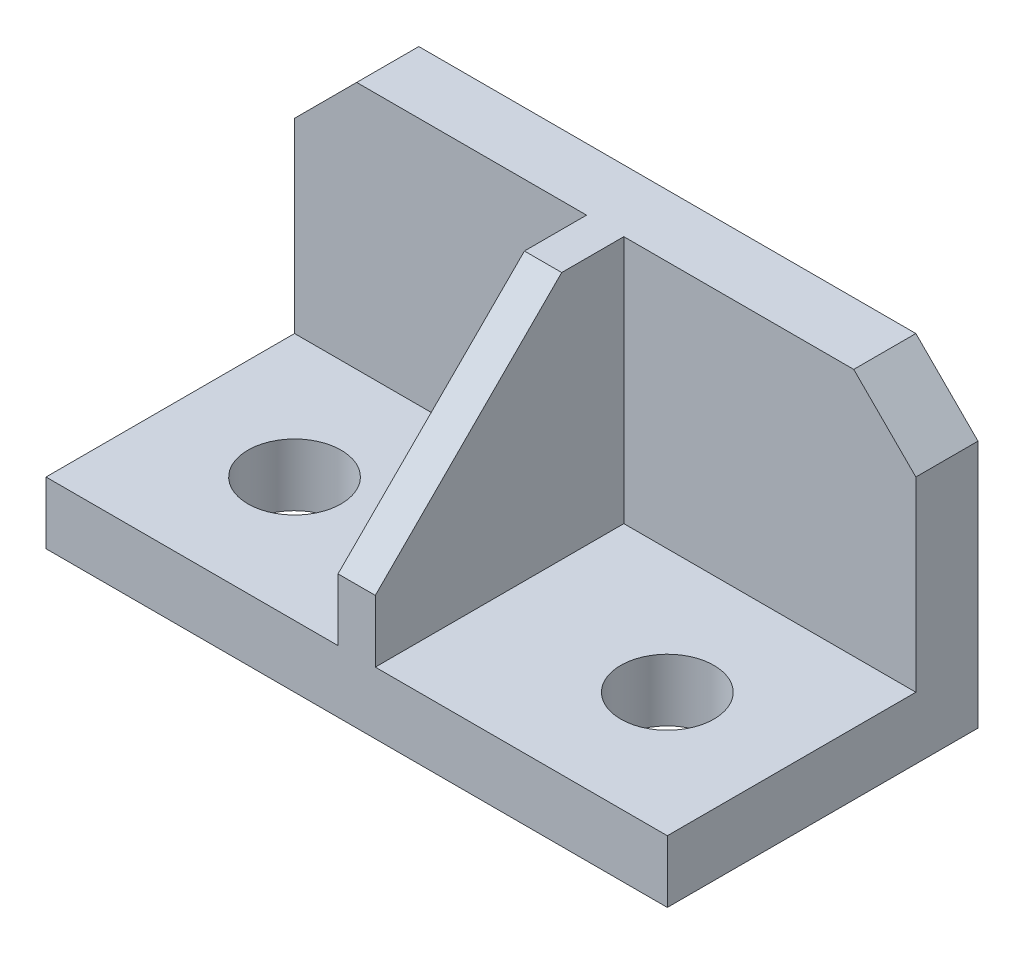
ISO-10303-21;
HEADER;
FILE_DESCRIPTION(('STEP AP214'),'2;1');
FILE_NAME('part.step','',(''),(''),'','','');
FILE_SCHEMA(('AUTOMOTIVE_DESIGN { 1 0 10303 214 1 1 1 1 }'));
ENDSEC;
DATA;
#1=APPLICATION_CONTEXT('core data for automotive mechanical design processes');
#2=APPLICATION_PROTOCOL_DEFINITION('international standard','automotive_design',2000,#1);
#3=PRODUCT_CONTEXT('',#1,'mechanical');
#4=PRODUCT('Part','Part','',(#3));
#5=PRODUCT_RELATED_PRODUCT_CATEGORY('part','',(#4));
#6=PRODUCT_DEFINITION_FORMATION('','',#4);
#7=PRODUCT_DEFINITION_CONTEXT('part definition',#1,'design');
#8=PRODUCT_DEFINITION('design','',#6,#7);
#9=PRODUCT_DEFINITION_SHAPE('','',#8);
#10=(LENGTH_UNIT() NAMED_UNIT(*) SI_UNIT(.MILLI.,.METRE.));
#11=(NAMED_UNIT(*) PLANE_ANGLE_UNIT() SI_UNIT($,.RADIAN.));
#12=(NAMED_UNIT(*) SI_UNIT($,.STERADIAN.) SOLID_ANGLE_UNIT());
#13=UNCERTAINTY_MEASURE_WITH_UNIT(LENGTH_MEASURE(1.E-05),#10,'distance_accuracy_value','');
#14=(GEOMETRIC_REPRESENTATION_CONTEXT(3) GLOBAL_UNCERTAINTY_ASSIGNED_CONTEXT((#13)) GLOBAL_UNIT_ASSIGNED_CONTEXT((#10,
#11,#12)) REPRESENTATION_CONTEXT('',''));
#15=CARTESIAN_POINT('',(0.,0.,0.));
#16=DIRECTION('',(0.,0.,1.));
#17=DIRECTION('',(1.,0.,0.));
#18=AXIS2_PLACEMENT_3D('',#15,#16,#17);
#19=CARTESIAN_POINT('',(0.,50.,-40.));
#20=DIRECTION('',(0.,0.,1.));
#21=DIRECTION('',(1.,0.,0.));
#22=AXIS2_PLACEMENT_3D('',#19,#20,#21);
#23=PLANE('',#22);
#24=DIRECTION('',(0.,-1.,0.));
#25=VECTOR('',#24,1.);
#26=CARTESIAN_POINT('',(100.,50.,-40.));
#27=LINE('',#26,#25);
#28=CARTESIAN_POINT('',(100.,40.,-40.));
#29=VERTEX_POINT('',#28);
#30=CARTESIAN_POINT('',(100.,10.,-40.));
#31=VERTEX_POINT('',#30);
#32=EDGE_CURVE('E182',#29,#31,#27,.T.);
#33=ORIENTED_EDGE('',*,*,#32,.F.);
#34=DIRECTION('',(0.707106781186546,-0.70710678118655,0.));
#35=VECTOR('',#34,1.);
#36=CARTESIAN_POINT('',(45.0000000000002,95.,-40.));
#37=LINE('',#36,#35);
#38=CARTESIAN_POINT('',(90.,50.,-40.));
#39=VERTEX_POINT('',#38);
#40=EDGE_CURVE('E224',#29,#39,#37,.F.);
#41=ORIENTED_EDGE('',*,*,#40,.T.);
#42=DIRECTION('',(-1.,0.,0.));
#43=VECTOR('',#42,1.);
#44=CARTESIAN_POINT('',(0.,50.,-40.));
#45=LINE('',#44,#43);
#46=CARTESIAN_POINT('',(53.,50.,-40.));
#47=VERTEX_POINT('',#46);
#48=EDGE_CURVE('E183',#39,#47,#45,.T.);
#49=ORIENTED_EDGE('',*,*,#48,.T.);
#50=DIRECTION('',(0.,-1.,0.));
#51=VECTOR('',#50,1.);
#52=CARTESIAN_POINT('',(53.,90.4474968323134,-40.));
#53=LINE('',#52,#51);
#54=CARTESIAN_POINT('',(53.,10.,-40.));
#55=VERTEX_POINT('',#54);
#56=EDGE_CURVE('E160',#47,#55,#53,.T.);
#57=ORIENTED_EDGE('',*,*,#56,.T.);
#58=DIRECTION('',(-1.,0.,0.));
#59=VECTOR('',#58,1.);
#60=CARTESIAN_POINT('',(0.,10.,-40.));
#61=LINE('',#60,#59);
#62=EDGE_CURVE('E175',#31,#55,#61,.T.);
#63=ORIENTED_EDGE('',*,*,#62,.F.);
#64=EDGE_LOOP('',(#33,#41,#49,#57,#63));
#65=FACE_BOUND('',#64,.T.);
#66=ADVANCED_FACE('F31',(#65),#23,.T.);
#67=CARTESIAN_POINT('',(47.,50.,-40.));
#68=VERTEX_POINT('',#67);
#69=CARTESIAN_POINT('',(10.,50.,-40.));
#70=VERTEX_POINT('',#69);
#71=EDGE_CURVE('E178',#68,#70,#45,.T.);
#72=ORIENTED_EDGE('',*,*,#71,.T.);
#73=DIRECTION('',(0.707106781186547,0.707106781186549,0.));
#74=VECTOR('',#73,1.);
#75=CARTESIAN_POINT('',(5.,45.,-40.));
#76=LINE('',#75,#74);
#77=CARTESIAN_POINT('',(0.,40.,-40.));
#78=VERTEX_POINT('',#77);
#79=EDGE_CURVE('E226',#70,#78,#76,.F.);
#80=ORIENTED_EDGE('',*,*,#79,.T.);
#81=DIRECTION('',(0.,-1.,0.));
#82=VECTOR('',#81,1.);
#83=CARTESIAN_POINT('',(0.,50.,-40.));
#84=LINE('',#83,#82);
#85=CARTESIAN_POINT('',(0.,10.,-40.));
#86=VERTEX_POINT('',#85);
#87=EDGE_CURVE('E180',#78,#86,#84,.T.);
#88=ORIENTED_EDGE('',*,*,#87,.T.);
#89=CARTESIAN_POINT('',(47.,10.,-40.));
#90=VERTEX_POINT('',#89);
#91=EDGE_CURVE('E179',#90,#86,#61,.T.);
#92=ORIENTED_EDGE('',*,*,#91,.F.);
#93=DIRECTION('',(0.,-1.,0.));
#94=VECTOR('',#93,1.);
#95=CARTESIAN_POINT('',(47.,90.4474968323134,-40.));
#96=LINE('',#95,#94);
#97=EDGE_CURVE('E150',#68,#90,#96,.T.);
#98=ORIENTED_EDGE('',*,*,#97,.F.);
#99=EDGE_LOOP('',(#72,#80,#88,#92,#98));
#100=FACE_BOUND('',#99,.T.);
#101=ADVANCED_FACE('F249',(#100),#23,.T.);
#102=CARTESIAN_POINT('',(0.,10.,-50.));
#103=DIRECTION('',(0.,-1.,0.));
#104=DIRECTION('',(0.,0.,-1.));
#105=AXIS2_PLACEMENT_3D('',#102,#103,#104);
#106=PLANE('',#105);
#107=CARTESIAN_POINT('',(80.,10.,-20.));
#108=DIRECTION('',(0.,1.,0.));
#109=DIRECTION('',(0.,0.,1.));
#110=AXIS2_PLACEMENT_3D('',#107,#108,#109);
#111=CIRCLE('',#110,7.50000000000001);
#112=CARTESIAN_POINT('',(80.,10.,-12.5));
#113=VERTEX_POINT('',#112);
#114=EDGE_CURVE('E167',#113,#113,#111,.T.);
#115=ORIENTED_EDGE('',*,*,#114,.F.);
#116=EDGE_LOOP('',(#115));
#117=FACE_BOUND('',#116,.T.);
#118=DIRECTION('',(0.,0.,-1.));
#119=VECTOR('',#118,1.);
#120=CARTESIAN_POINT('',(53.,10.,-40.));
#121=LINE('',#120,#119);
#122=CARTESIAN_POINT('',(53.,10.,0.));
#123=VERTEX_POINT('',#122);
#124=EDGE_CURVE('E151',#123,#55,#121,.T.);
#125=ORIENTED_EDGE('',*,*,#124,.F.);
#126=DIRECTION('',(1.,0.,0.));
#127=VECTOR('',#126,1.);
#128=CARTESIAN_POINT('',(0.,10.,0.));
#129=LINE('',#128,#127);
#130=CARTESIAN_POINT('',(100.,10.,0.));
#131=VERTEX_POINT('',#130);
#132=EDGE_CURVE('E145',#123,#131,#129,.T.);
#133=ORIENTED_EDGE('',*,*,#132,.T.);
#134=DIRECTION('',(0.,0.,-1.));
#135=VECTOR('',#134,1.);
#136=CARTESIAN_POINT('',(100.,10.,-50.0000000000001));
#137=LINE('',#136,#135);
#138=EDGE_CURVE('E144',#131,#31,#137,.T.);
#139=ORIENTED_EDGE('',*,*,#138,.T.);
#140=ORIENTED_EDGE('',*,*,#62,.T.);
#141=EDGE_LOOP('',(#125,#133,#139,#140));
#142=FACE_BOUND('',#141,.T.);
#143=ADVANCED_FACE('F263',(#117,#142),#106,.F.);
#144=CARTESIAN_POINT('',(20.,10.,-20.));
#145=DIRECTION('',(0.,1.,0.));
#146=DIRECTION('',(0.,0.,1.));
#147=AXIS2_PLACEMENT_3D('',#144,#145,#146);
#148=CIRCLE('',#147,7.5);
#149=CARTESIAN_POINT('',(20.,10.,-12.5));
#150=VERTEX_POINT('',#149);
#151=EDGE_CURVE('E166',#150,#150,#148,.T.);
#152=ORIENTED_EDGE('',*,*,#151,.F.);
#153=EDGE_LOOP('',(#152));
#154=FACE_BOUND('',#153,.T.);
#155=DIRECTION('',(0.,0.,1.));
#156=VECTOR('',#155,1.);
#157=CARTESIAN_POINT('',(47.,10.,-40.));
#158=LINE('',#157,#156);
#159=CARTESIAN_POINT('',(47.,10.,0.));
#160=VERTEX_POINT('',#159);
#161=EDGE_CURVE('E140',#90,#160,#158,.T.);
#162=ORIENTED_EDGE('',*,*,#161,.F.);
#163=ORIENTED_EDGE('',*,*,#91,.T.);
#164=DIRECTION('',(0.,0.,1.));
#165=VECTOR('',#164,1.);
#166=CARTESIAN_POINT('',(0.,10.,-50.));
#167=LINE('',#166,#165);
#168=CARTESIAN_POINT('',(0.,10.,0.));
#169=VERTEX_POINT('',#168);
#170=EDGE_CURVE('E143',#86,#169,#167,.T.);
#171=ORIENTED_EDGE('',*,*,#170,.T.);
#172=EDGE_CURVE('E129',#169,#160,#129,.T.);
#173=ORIENTED_EDGE('',*,*,#172,.T.);
#174=EDGE_LOOP('',(#162,#163,#171,#173));
#175=FACE_BOUND('',#174,.T.);
#176=ADVANCED_FACE('F138',(#154,#175),#106,.F.);
#177=CARTESIAN_POINT('',(0.,50.,0.));
#178=DIRECTION('',(1.,0.,0.));
#179=DIRECTION('',(0.,0.,-1.));
#180=AXIS2_PLACEMENT_3D('',#177,#178,#179);
#181=PLANE('',#180);
#182=ORIENTED_EDGE('',*,*,#87,.F.);
#183=DIRECTION('',(0.,0.,-1.));
#184=VECTOR('',#183,1.);
#185=CARTESIAN_POINT('',(0.,40.,0.));
#186=LINE('',#185,#184);
#187=CARTESIAN_POINT('',(0.,40.,-50.));
#188=VERTEX_POINT('',#187);
#189=EDGE_CURVE('E228',#78,#188,#186,.T.);
#190=ORIENTED_EDGE('',*,*,#189,.T.);
#191=DIRECTION('',(0.,-1.,0.));
#192=VECTOR('',#191,1.);
#193=CARTESIAN_POINT('',(0.,50.,-50.));
#194=LINE('',#193,#192);
#195=CARTESIAN_POINT('',(0.,0.,-50.));
#196=VERTEX_POINT('',#195);
#197=EDGE_CURVE('E193',#188,#196,#194,.T.);
#198=ORIENTED_EDGE('',*,*,#197,.T.);
#199=DIRECTION('',(0.,0.,1.));
#200=VECTOR('',#199,1.);
#201=CARTESIAN_POINT('',(0.,0.,0.));
#202=LINE('',#201,#200);
#203=CARTESIAN_POINT('',(0.,0.,0.));
#204=VERTEX_POINT('',#203);
#205=EDGE_CURVE('E188',#196,#204,#202,.T.);
#206=ORIENTED_EDGE('',*,*,#205,.T.);
#207=DIRECTION('',(0.,-1.,0.));
#208=VECTOR('',#207,1.);
#209=CARTESIAN_POINT('',(0.,50.,0.));
#210=LINE('',#209,#208);
#211=EDGE_CURVE('E210',#169,#204,#210,.T.);
#212=ORIENTED_EDGE('',*,*,#211,.F.);
#213=ORIENTED_EDGE('',*,*,#170,.F.);
#214=EDGE_LOOP('',(#182,#190,#198,#206,#212,#213));
#215=FACE_BOUND('',#214,.T.);
#216=ADVANCED_FACE('F235',(#215),#181,.F.);
#217=CARTESIAN_POINT('',(0.,50.,0.));
#218=DIRECTION('',(0.,0.,-1.));
#219=DIRECTION('',(-1.,0.,0.));
#220=AXIS2_PLACEMENT_3D('',#217,#218,#219);
#221=PLANE('',#220);
#222=DIRECTION('',(0.,-1.,0.));
#223=VECTOR('',#222,1.);
#224=CARTESIAN_POINT('',(53.,90.4474968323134,0.));
#225=LINE('',#224,#223);
#226=CARTESIAN_POINT('',(53.,20.,0.));
#227=VERTEX_POINT('',#226);
#228=EDGE_CURVE('E135',#227,#123,#225,.T.);
#229=ORIENTED_EDGE('',*,*,#228,.F.);
#230=DIRECTION('',(-1.,0.,0.));
#231=VECTOR('',#230,1.);
#232=CARTESIAN_POINT('',(0.,20.,0.));
#233=LINE('',#232,#231);
#234=CARTESIAN_POINT('',(47.,20.,0.));
#235=VERTEX_POINT('',#234);
#236=EDGE_CURVE('E132',#227,#235,#233,.T.);
#237=ORIENTED_EDGE('',*,*,#236,.T.);
#238=DIRECTION('',(0.,-1.,0.));
#239=VECTOR('',#238,1.);
#240=CARTESIAN_POINT('',(47.,90.4474968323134,0.));
#241=LINE('',#240,#239);
#242=EDGE_CURVE('E125',#235,#160,#241,.T.);
#243=ORIENTED_EDGE('',*,*,#242,.T.);
#244=ORIENTED_EDGE('',*,*,#172,.F.);
#245=ORIENTED_EDGE('',*,*,#211,.T.);
#246=DIRECTION('',(1.,0.,0.));
#247=VECTOR('',#246,1.);
#248=CARTESIAN_POINT('',(0.,0.,0.));
#249=LINE('',#248,#247);
#250=CARTESIAN_POINT('',(100.,0.,0.));
#251=VERTEX_POINT('',#250);
#252=EDGE_CURVE('E197',#204,#251,#249,.T.);
#253=ORIENTED_EDGE('',*,*,#252,.T.);
#254=DIRECTION('',(0.,-1.,0.));
#255=VECTOR('',#254,1.);
#256=CARTESIAN_POINT('',(100.,50.,0.));
#257=LINE('',#256,#255);
#258=EDGE_CURVE('E208',#131,#251,#257,.T.);
#259=ORIENTED_EDGE('',*,*,#258,.F.);
#260=ORIENTED_EDGE('',*,*,#132,.F.);
#261=EDGE_LOOP('',(#229,#237,#243,#244,#245,#253,#259,#260));
#262=FACE_BOUND('',#261,.T.);
#263=ADVANCED_FACE('F128',(#262),#221,.F.);
#264=CARTESIAN_POINT('',(100.,50.,0.));
#265=DIRECTION('',(-1.,0.,0.));
#266=DIRECTION('',(0.,0.,1.));
#267=AXIS2_PLACEMENT_3D('',#264,#265,#266);
#268=PLANE('',#267);
#269=DIRECTION('',(0.,-1.,0.));
#270=VECTOR('',#269,1.);
#271=CARTESIAN_POINT('',(100.,50.,-50.));
#272=LINE('',#271,#270);
#273=CARTESIAN_POINT('',(100.,40.,-50.));
#274=VERTEX_POINT('',#273);
#275=CARTESIAN_POINT('',(100.,0.,-50.));
#276=VERTEX_POINT('',#275);
#277=EDGE_CURVE('E206',#274,#276,#272,.T.);
#278=ORIENTED_EDGE('',*,*,#277,.F.);
#279=DIRECTION('',(0.,0.,1.));
#280=VECTOR('',#279,1.);
#281=CARTESIAN_POINT('',(100.,40.,0.));
#282=LINE('',#281,#280);
#283=EDGE_CURVE('E222',#274,#29,#282,.T.);
#284=ORIENTED_EDGE('',*,*,#283,.T.);
#285=ORIENTED_EDGE('',*,*,#32,.T.);
#286=ORIENTED_EDGE('',*,*,#138,.F.);
#287=ORIENTED_EDGE('',*,*,#258,.T.);
#288=DIRECTION('',(0.,0.,-1.));
#289=VECTOR('',#288,1.);
#290=CARTESIAN_POINT('',(100.,0.,0.));
#291=LINE('',#290,#289);
#292=EDGE_CURVE('E200',#251,#276,#291,.T.);
#293=ORIENTED_EDGE('',*,*,#292,.T.);
#294=EDGE_LOOP('',(#278,#284,#285,#286,#287,#293));
#295=FACE_BOUND('',#294,.T.);
#296=ADVANCED_FACE('F257',(#295),#268,.F.);
#297=CARTESIAN_POINT('',(0.,50.,-50.));
#298=DIRECTION('',(0.,-1.,0.));
#299=DIRECTION('',(0.,0.,-1.));
#300=AXIS2_PLACEMENT_3D('',#297,#298,#299);
#301=PLANE('',#300);
#302=DIRECTION('',(0.,0.,-1.));
#303=VECTOR('',#302,1.);
#304=CARTESIAN_POINT('',(47.,50.,-40.));
#305=LINE('',#304,#303);
#306=CARTESIAN_POINT('',(47.,50.,-30.0000000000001));
#307=VERTEX_POINT('',#306);
#308=EDGE_CURVE('E156',#307,#68,#305,.T.);
#309=ORIENTED_EDGE('',*,*,#308,.F.);
#310=DIRECTION('',(1.,0.,0.));
#311=VECTOR('',#310,1.);
#312=CARTESIAN_POINT('',(0.,50.,-30.0000000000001));
#313=LINE('',#312,#311);
#314=CARTESIAN_POINT('',(53.,50.,-30.0000000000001));
#315=VERTEX_POINT('',#314);
#316=EDGE_CURVE('E39',#307,#315,#313,.T.);
#317=ORIENTED_EDGE('',*,*,#316,.T.);
#318=DIRECTION('',(0.,0.,1.));
#319=VECTOR('',#318,1.);
#320=CARTESIAN_POINT('',(53.,50.,-40.));
#321=LINE('',#320,#319);
#322=EDGE_CURVE('E134',#47,#315,#321,.T.);
#323=ORIENTED_EDGE('',*,*,#322,.F.);
#324=ORIENTED_EDGE('',*,*,#48,.F.);
#325=DIRECTION('',(0.,0.,-1.));
#326=VECTOR('',#325,1.);
#327=CARTESIAN_POINT('',(90.,50.,-50.));
#328=LINE('',#327,#326);
#329=CARTESIAN_POINT('',(90.,50.,-50.));
#330=VERTEX_POINT('',#329);
#331=EDGE_CURVE('E215',#39,#330,#328,.T.);
#332=ORIENTED_EDGE('',*,*,#331,.T.);
#333=DIRECTION('',(-1.,0.,0.));
#334=VECTOR('',#333,1.);
#335=CARTESIAN_POINT('',(0.,50.,-50.));
#336=LINE('',#335,#334);
#337=CARTESIAN_POINT('',(9.99999999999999,50.,-50.));
#338=VERTEX_POINT('',#337);
#339=EDGE_CURVE('E190',#330,#338,#336,.T.);
#340=ORIENTED_EDGE('',*,*,#339,.T.);
#341=DIRECTION('',(0.,0.,1.));
#342=VECTOR('',#341,1.);
#343=CARTESIAN_POINT('',(9.99999999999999,50.,-50.));
#344=LINE('',#343,#342);
#345=EDGE_CURVE('E212',#338,#70,#344,.T.);
#346=ORIENTED_EDGE('',*,*,#345,.T.);
#347=ORIENTED_EDGE('',*,*,#71,.F.);
#348=EDGE_LOOP('',(#309,#317,#323,#324,#332,#340,#346,#347));
#349=FACE_BOUND('',#348,.T.);
#350=ADVANCED_FACE('F247',(#349),#301,.F.);
#351=CARTESIAN_POINT('',(0.,50.,-50.));
#352=DIRECTION('',(0.,0.,1.));
#353=DIRECTION('',(1.,0.,0.));
#354=AXIS2_PLACEMENT_3D('',#351,#352,#353);
#355=PLANE('',#354);
#356=ORIENTED_EDGE('',*,*,#339,.F.);
#357=DIRECTION('',(-0.707106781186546,0.70710678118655,0.));
#358=VECTOR('',#357,1.);
#359=CARTESIAN_POINT('',(90.,50.,-50.));
#360=LINE('',#359,#358);
#361=EDGE_CURVE('E220',#330,#274,#360,.F.);
#362=ORIENTED_EDGE('',*,*,#361,.T.);
#363=ORIENTED_EDGE('',*,*,#277,.T.);
#364=DIRECTION('',(-1.,0.,0.));
#365=VECTOR('',#364,1.);
#366=CARTESIAN_POINT('',(0.,0.,-50.));
#367=LINE('',#366,#365);
#368=EDGE_CURVE('E194',#276,#196,#367,.T.);
#369=ORIENTED_EDGE('',*,*,#368,.T.);
#370=ORIENTED_EDGE('',*,*,#197,.F.);
#371=DIRECTION('',(-0.707106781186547,-0.707106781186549,0.));
#372=VECTOR('',#371,1.);
#373=CARTESIAN_POINT('',(9.99999999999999,50.,-50.));
#374=LINE('',#373,#372);
#375=EDGE_CURVE('E218',#188,#338,#374,.F.);
#376=ORIENTED_EDGE('',*,*,#375,.T.);
#377=EDGE_LOOP('',(#356,#362,#363,#369,#370,#376));
#378=FACE_BOUND('',#377,.T.);
#379=ADVANCED_FACE('F240',(#378),#355,.F.);
#380=CARTESIAN_POINT('',(0.,0.,-50.));
#381=DIRECTION('',(0.,-1.,0.));
#382=DIRECTION('',(0.,0.,-1.));
#383=AXIS2_PLACEMENT_3D('',#380,#381,#382);
#384=PLANE('',#383);
#385=CARTESIAN_POINT('',(80.,0.,-20.));
#386=DIRECTION('',(0.,1.,0.));
#387=DIRECTION('',(0.,0.,1.));
#388=AXIS2_PLACEMENT_3D('',#385,#386,#387);
#389=CIRCLE('',#388,7.50000000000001);
#390=CARTESIAN_POINT('',(80.,0.,-12.5));
#391=VERTEX_POINT('',#390);
#392=EDGE_CURVE('E163',#391,#391,#389,.T.);
#393=ORIENTED_EDGE('',*,*,#392,.T.);
#394=EDGE_LOOP('',(#393));
#395=FACE_BOUND('',#394,.T.);
#396=CARTESIAN_POINT('',(20.,0.,-20.));
#397=DIRECTION('',(0.,1.,0.));
#398=DIRECTION('',(0.,0.,1.));
#399=AXIS2_PLACEMENT_3D('',#396,#397,#398);
#400=CIRCLE('',#399,7.5);
#401=CARTESIAN_POINT('',(20.,0.,-12.5));
#402=VERTEX_POINT('',#401);
#403=EDGE_CURVE('E170',#402,#402,#400,.T.);
#404=ORIENTED_EDGE('',*,*,#403,.T.);
#405=EDGE_LOOP('',(#404));
#406=FACE_BOUND('',#405,.T.);
#407=ORIENTED_EDGE('',*,*,#205,.F.);
#408=ORIENTED_EDGE('',*,*,#368,.F.);
#409=ORIENTED_EDGE('',*,*,#292,.F.);
#410=ORIENTED_EDGE('',*,*,#252,.F.);
#411=EDGE_LOOP('',(#407,#408,#409,#410));
#412=FACE_BOUND('',#411,.T.);
#413=ADVANCED_FACE('F254',(#395,#406,#412),#384,.T.);
#414=CARTESIAN_POINT('',(20.,0.,-20.));
#415=DIRECTION('',(0.,1.,0.));
#416=DIRECTION('',(0.,0.,1.));
#417=AXIS2_PLACEMENT_3D('',#414,#415,#416);
#418=CYLINDRICAL_SURFACE('',#417,7.5);
#419=ORIENTED_EDGE('',*,*,#403,.F.);
#420=EDGE_LOOP('',(#419));
#421=FACE_BOUND('',#420,.T.);
#422=ORIENTED_EDGE('',*,*,#151,.T.);
#423=EDGE_LOOP('',(#422));
#424=FACE_BOUND('',#423,.T.);
#425=ADVANCED_FACE('F284',(#421,#424),#418,.F.);
#426=CARTESIAN_POINT('',(80.,0.,-20.));
#427=DIRECTION('',(0.,1.,0.));
#428=DIRECTION('',(0.,0.,1.));
#429=AXIS2_PLACEMENT_3D('',#426,#427,#428);
#430=CYLINDRICAL_SURFACE('',#429,7.50000000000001);
#431=ORIENTED_EDGE('',*,*,#392,.F.);
#432=EDGE_LOOP('',(#431));
#433=FACE_BOUND('',#432,.T.);
#434=ORIENTED_EDGE('',*,*,#114,.T.);
#435=EDGE_LOOP('',(#434));
#436=FACE_BOUND('',#435,.T.);
#437=ADVANCED_FACE('F314',(#433,#436),#430,.F.);
#438=CARTESIAN_POINT('',(53.,90.4474968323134,-40.));
#439=DIRECTION('',(-1.,0.,0.));
#440=DIRECTION('',(0.,0.,1.));
#441=AXIS2_PLACEMENT_3D('',#438,#439,#440);
#442=PLANE('',#441);
#443=ORIENTED_EDGE('',*,*,#322,.T.);
#444=DIRECTION('',(0.,0.707106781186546,-0.707106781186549));
#445=VECTOR('',#444,1.);
#446=CARTESIAN_POINT('',(53.,20.,0.));
#447=LINE('',#446,#445);
#448=EDGE_CURVE('E11',#315,#227,#447,.F.);
#449=ORIENTED_EDGE('',*,*,#448,.T.);
#450=ORIENTED_EDGE('',*,*,#228,.T.);
#451=ORIENTED_EDGE('',*,*,#124,.T.);
#452=ORIENTED_EDGE('',*,*,#56,.F.);
#453=EDGE_LOOP('',(#443,#449,#450,#451,#452));
#454=FACE_BOUND('',#453,.T.);
#455=ADVANCED_FACE('F267',(#454),#442,.F.);
#456=CARTESIAN_POINT('',(47.,90.4474968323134,-40.));
#457=DIRECTION('',(1.,0.,0.));
#458=DIRECTION('',(0.,0.,-1.));
#459=AXIS2_PLACEMENT_3D('',#456,#457,#458);
#460=PLANE('',#459);
#461=ORIENTED_EDGE('',*,*,#242,.F.);
#462=DIRECTION('',(0.,-0.707106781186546,0.707106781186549));
#463=VECTOR('',#462,1.);
#464=CARTESIAN_POINT('',(47.,20.,0.));
#465=LINE('',#464,#463);
#466=EDGE_CURVE('E53',#235,#307,#465,.F.);
#467=ORIENTED_EDGE('',*,*,#466,.T.);
#468=ORIENTED_EDGE('',*,*,#308,.T.);
#469=ORIENTED_EDGE('',*,*,#97,.T.);
#470=ORIENTED_EDGE('',*,*,#161,.T.);
#471=EDGE_LOOP('',(#461,#467,#468,#469,#470));
#472=FACE_BOUND('',#471,.T.);
#473=ADVANCED_FACE('F148',(#472),#460,.F.);
#474=CARTESIAN_POINT('',(90.,50.,-50.));
#475=DIRECTION('',(-0.707106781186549,-0.707106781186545,0.));
#476=DIRECTION('',(0.707106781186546,-0.70710678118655,0.));
#477=AXIS2_PLACEMENT_3D('',#474,#475,#476);
#478=PLANE('',#477);
#479=ORIENTED_EDGE('',*,*,#40,.F.);
#480=ORIENTED_EDGE('',*,*,#283,.F.);
#481=ORIENTED_EDGE('',*,*,#361,.F.);
#482=ORIENTED_EDGE('',*,*,#331,.F.);
#483=EDGE_LOOP('',(#479,#480,#481,#482));
#484=FACE_BOUND('',#483,.T.);
#485=ADVANCED_FACE('F274',(#484),#478,.F.);
#486=CARTESIAN_POINT('',(9.99999999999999,50.,-50.));
#487=DIRECTION('',(0.707106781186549,-0.707106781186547,0.));
#488=DIRECTION('',(0.707106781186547,0.707106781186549,0.));
#489=AXIS2_PLACEMENT_3D('',#486,#487,#488);
#490=PLANE('',#489);
#491=ORIENTED_EDGE('',*,*,#375,.F.);
#492=ORIENTED_EDGE('',*,*,#189,.F.);
#493=ORIENTED_EDGE('',*,*,#79,.F.);
#494=ORIENTED_EDGE('',*,*,#345,.F.);
#495=EDGE_LOOP('',(#491,#492,#493,#494));
#496=FACE_BOUND('',#495,.T.);
#497=ADVANCED_FACE('F244',(#496),#490,.F.);
#498=CARTESIAN_POINT('',(0.,20.,0.));
#499=DIRECTION('',(0.,-0.707106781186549,-0.707106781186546));
#500=DIRECTION('',(0.,0.707106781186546,-0.707106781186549));
#501=AXIS2_PLACEMENT_3D('',#498,#499,#500);
#502=PLANE('',#501);
#503=ORIENTED_EDGE('',*,*,#448,.F.);
#504=ORIENTED_EDGE('',*,*,#316,.F.);
#505=ORIENTED_EDGE('',*,*,#466,.F.);
#506=ORIENTED_EDGE('',*,*,#236,.F.);
#507=EDGE_LOOP('',(#503,#504,#505,#506));
#508=FACE_BOUND('',#507,.T.);
#509=ADVANCED_FACE('F33',(#508),#502,.F.);
#510=CLOSED_SHELL('',(#66,#101,#143,#176,#216,#263,#296,#350,#379,#413,#425,#437,#455,#473,#485,
#497,#509));
#511=MANIFOLD_SOLID_BREP('B2',#510);
#512=ADVANCED_BREP_SHAPE_REPRESENTATION('',(#18,#511),#14);
#513=SHAPE_DEFINITION_REPRESENTATION(#9,#512);
ENDSEC;
END-ISO-10303-21;
